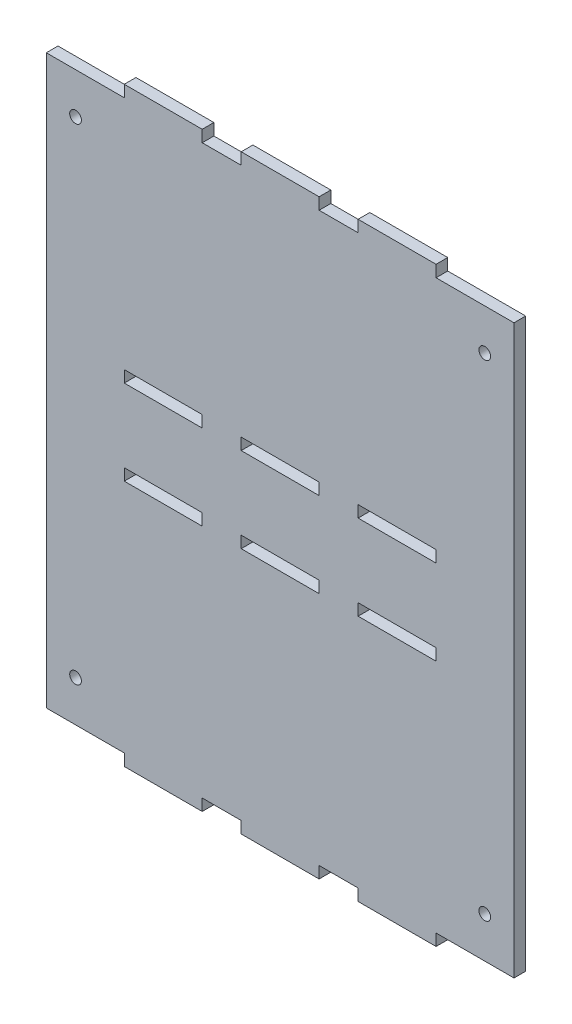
from build123d import *

# Parameters (mm, degrees)
ESQUISSE1_R        = 1.5
ESQUISSE1_W        = 20
ESQUISSE1_H        = 3
BOSS_EXTRU_1_DEPTH = 3


with BuildPart() as part:
    # Esquisse1 → Boss.-Extru.1 (new body)
    with BuildSketch(Plane.XY):
        Polygon((-10, 0), (10, 0), (10, -3), (20, -3), (20, 0), (40, 0), (40, -3), (60, -3), (60, -148.6), (40, -148.6), (40, -151.6), (20, -151.6), (20, -148.6), (10, -148.6), (10, -151.6), (-10, -151.6), (-10, -148.6), (-20, -148.6), (-20, -151.6), (-40, -151.6), (-40, -148.6), (-60, -148.6), (-60, -3), (-40, -3), (-40, 0), (-20, 0), (-20, -3), (-10, -3), align=None)
        with Locations((52.5, -13.5)):
            Circle(ESQUISSE1_R, mode=Mode.SUBTRACT)
        with Locations((-52.5, -13.5)):
            Circle(ESQUISSE1_R, mode=Mode.SUBTRACT)
        with Locations((52.5, -138.1)):
            Circle(ESQUISSE1_R, mode=Mode.SUBTRACT)
        with Locations((-52.5, -138.1)):
            Circle(ESQUISSE1_R, mode=Mode.SUBTRACT)
        with Locations((30, -64.9)):
            Rectangle(ESQUISSE1_W, ESQUISSE1_H, mode=Mode.SUBTRACT)
        with Locations((0, -64.9)):
            Rectangle(ESQUISSE1_W, ESQUISSE1_H, mode=Mode.SUBTRACT)
        with Locations((-30, -64.9)):
            Rectangle(ESQUISSE1_W, ESQUISSE1_H, mode=Mode.SUBTRACT)
        with Locations((-30, -86.7)):
            Rectangle(ESQUISSE1_W, ESQUISSE1_H, mode=Mode.SUBTRACT)
        with Locations((0, -86.7)):
            Rectangle(ESQUISSE1_W, ESQUISSE1_H, mode=Mode.SUBTRACT)
        with Locations((30, -86.7)):
            Rectangle(ESQUISSE1_W, ESQUISSE1_H, mode=Mode.SUBTRACT)
    extrude(amount=BOSS_EXTRU_1_DEPTH)


solid = part.part
